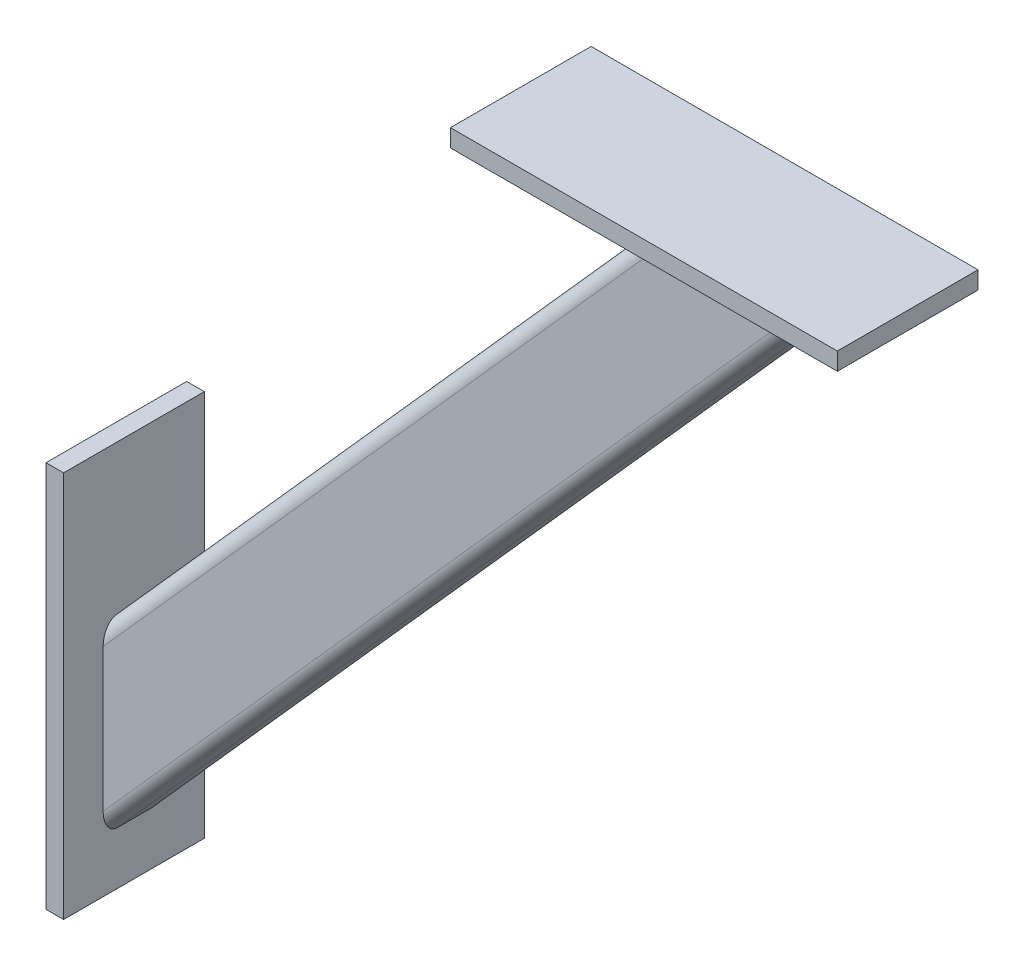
ISO-10303-21;
HEADER;
FILE_DESCRIPTION(('STEP AP214'),'2;1');
FILE_NAME('part.step','',(''),(''),'','','');
FILE_SCHEMA(('AUTOMOTIVE_DESIGN { 1 0 10303 214 1 1 1 1 }'));
ENDSEC;
DATA;
#1=APPLICATION_CONTEXT('core data for automotive mechanical design processes');
#2=APPLICATION_PROTOCOL_DEFINITION('international standard','automotive_design',2000,#1);
#3=PRODUCT_CONTEXT('',#1,'mechanical');
#4=PRODUCT('Part','Part','',(#3));
#5=PRODUCT_RELATED_PRODUCT_CATEGORY('part','',(#4));
#6=PRODUCT_DEFINITION_FORMATION('','',#4);
#7=PRODUCT_DEFINITION_CONTEXT('part definition',#1,'design');
#8=PRODUCT_DEFINITION('design','',#6,#7);
#9=PRODUCT_DEFINITION_SHAPE('','',#8);
#10=(LENGTH_UNIT() NAMED_UNIT(*) SI_UNIT(.MILLI.,.METRE.));
#11=(NAMED_UNIT(*) PLANE_ANGLE_UNIT() SI_UNIT($,.RADIAN.));
#12=(NAMED_UNIT(*) SI_UNIT($,.STERADIAN.) SOLID_ANGLE_UNIT());
#13=UNCERTAINTY_MEASURE_WITH_UNIT(LENGTH_MEASURE(1.E-05),#10,'distance_accuracy_value','');
#14=(GEOMETRIC_REPRESENTATION_CONTEXT(3) GLOBAL_UNCERTAINTY_ASSIGNED_CONTEXT((#13)) GLOBAL_UNIT_ASSIGNED_CONTEXT((#10,
#11,#12)) REPRESENTATION_CONTEXT('',''));
#15=CARTESIAN_POINT('',(0.,0.,0.));
#16=DIRECTION('',(0.,0.,1.));
#17=DIRECTION('',(1.,0.,0.));
#18=AXIS2_PLACEMENT_3D('',#15,#16,#17);
#19=CARTESIAN_POINT('',(-53.4243845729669,-447.977901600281,17.5));
#20=DIRECTION('',(0.,0.,-1.));
#21=DIRECTION('',(-1.,0.,0.));
#22=AXIS2_PLACEMENT_3D('',#19,#20,#21);
#23=PLANE('',#22);
#24=DIRECTION('',(0.,1.,0.));
#25=VECTOR('',#24,1.);
#26=CARTESIAN_POINT('',(10.,-447.977901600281,17.5));
#27=LINE('',#26,#25);
#28=CARTESIAN_POINT('',(10.0000000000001,-457.976623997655,17.5));
#29=VERTEX_POINT('',#28);
#30=CARTESIAN_POINT('',(10.,-376.81883598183,17.5));
#31=VERTEX_POINT('',#30);
#32=EDGE_CURVE('E14',#29,#31,#27,.T.);
#33=ORIENTED_EDGE('',*,*,#32,.F.);
#34=DIRECTION('',(0.665370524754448,0.746513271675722,0.));
#35=VECTOR('',#34,1.);
#36=CARTESIAN_POINT('',(-13.1126679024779,-483.907909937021,17.5));
#37=LINE('',#36,#35);
#38=CARTESIAN_POINT('',(409.283512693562,-10.,17.5));
#39=VERTEX_POINT('',#38);
#40=EDGE_CURVE('E200',#29,#39,#37,.T.);
#41=ORIENTED_EDGE('',*,*,#40,.T.);
#42=DIRECTION('',(1.,0.,0.));
#43=VECTOR('',#42,1.);
#44=CARTESIAN_POINT('',(-53.4243845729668,-9.99999999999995,17.5));
#45=LINE('',#44,#43);
#46=CARTESIAN_POINT('',(336.947223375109,-10.,17.5));
#47=VERTEX_POINT('',#46);
#48=EDGE_CURVE('E81',#47,#39,#45,.T.);
#49=ORIENTED_EDGE('',*,*,#48,.F.);
#50=DIRECTION('',(0.665370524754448,0.746513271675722,0.));
#51=VECTOR('',#50,1.);
#52=CARTESIAN_POINT('',(-53.4243845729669,-447.977901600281,17.5));
#53=LINE('',#52,#51);
#54=EDGE_CURVE('E206',#31,#47,#53,.T.);
#55=ORIENTED_EDGE('',*,*,#54,.F.);
#56=EDGE_LOOP('',(#33,#41,#49,#55));
#57=FACE_BOUND('',#56,.T.);
#58=ADVANCED_FACE('F73',(#57),#23,.F.);
#59=CARTESIAN_POINT('',(-13.1126679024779,-483.907909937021,9.49999999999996));
#60=DIRECTION('',(0.665370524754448,0.746513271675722,0.));
#61=DIRECTION('',(-0.746513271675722,0.665370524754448,0.));
#62=AXIS2_PLACEMENT_3D('',#59,#60,#61);
#63=CYLINDRICAL_SURFACE('',#62,8.00000000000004);
#64=CARTESIAN_POINT('',(10.0000000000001,-457.976623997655,9.49999999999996));
#65=DIRECTION('',(-1.,0.,0.));
#66=DIRECTION('',(0.,1.,0.));
#67=AXIS2_PLACEMENT_3D('',#64,#65,#66);
#68=ELLIPSE('',#67,12.0233760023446,8.00000000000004);
#69=CARTESIAN_POINT('',(10.0000000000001,-470.,9.49999999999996));
#70=VERTEX_POINT('',#69);
#71=EDGE_CURVE('E261',#70,#29,#68,.T.);
#72=ORIENTED_EDGE('',*,*,#71,.F.);
#73=DIRECTION('',(0.665370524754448,0.746513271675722,0.));
#74=VECTOR('',#73,1.);
#75=CARTESIAN_POINT('',(-7.14056172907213,-489.230874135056,9.49999999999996));
#76=LINE('',#75,#74);
#77=CARTESIAN_POINT('',(420.,-10.0000000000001,9.49999999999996));
#78=VERTEX_POINT('',#77);
#79=EDGE_CURVE('E202',#70,#78,#76,.T.);
#80=ORIENTED_EDGE('',*,*,#79,.T.);
#81=CARTESIAN_POINT('',(409.283512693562,-10.,9.49999999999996));
#82=DIRECTION('',(0.,1.,0.));
#83=DIRECTION('',(1.,0.,0.));
#84=AXIS2_PLACEMENT_3D('',#81,#82,#83);
#85=ELLIPSE('',#84,10.7164873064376,8.00000000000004);
#86=EDGE_CURVE('E186',#39,#78,#85,.T.);
#87=ORIENTED_EDGE('',*,*,#86,.F.);
#88=ORIENTED_EDGE('',*,*,#40,.F.);
#89=EDGE_LOOP('',(#72,#80,#87,#88));
#90=FACE_BOUND('',#89,.T.);
#91=ADVANCED_FACE('F199',(#90),#63,.T.);
#92=CARTESIAN_POINT('',(-7.14056172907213,-489.230874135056,9.49999999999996));
#93=DIRECTION('',(-0.746513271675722,0.665370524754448,0.));
#94=DIRECTION('',(-0.665370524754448,-0.746513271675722,0.));
#95=AXIS2_PLACEMENT_3D('',#92,#93,#94);
#96=PLANE('',#95);
#97=DIRECTION('',(0.,0.,1.));
#98=VECTOR('',#97,1.);
#99=CARTESIAN_POINT('',(10.0000000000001,-470.,9.49999999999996));
#100=LINE('',#99,#98);
#101=CARTESIAN_POINT('',(10.0000000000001,-470.,-9.49999999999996));
#102=VERTEX_POINT('',#101);
#103=EDGE_CURVE('E263',#102,#70,#100,.T.);
#104=ORIENTED_EDGE('',*,*,#103,.F.);
#105=DIRECTION('',(0.665370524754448,0.746513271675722,0.));
#106=VECTOR('',#105,1.);
#107=CARTESIAN_POINT('',(-7.14056172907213,-489.230874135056,-9.49999999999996));
#108=LINE('',#107,#106);
#109=CARTESIAN_POINT('',(420.,-10.0000000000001,-9.49999999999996));
#110=VERTEX_POINT('',#109);
#111=EDGE_CURVE('E208',#102,#110,#108,.T.);
#112=ORIENTED_EDGE('',*,*,#111,.T.);
#113=DIRECTION('',(0.,0.,-1.));
#114=VECTOR('',#113,1.);
#115=CARTESIAN_POINT('',(420.,-10.0000000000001,9.49999999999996));
#116=LINE('',#115,#114);
#117=EDGE_CURVE('E203',#78,#110,#116,.T.);
#118=ORIENTED_EDGE('',*,*,#117,.F.);
#119=ORIENTED_EDGE('',*,*,#79,.F.);
#120=EDGE_LOOP('',(#104,#112,#118,#119));
#121=FACE_BOUND('',#120,.T.);
#122=ADVANCED_FACE('F348',(#121),#96,.F.);
#123=CARTESIAN_POINT('',(-13.1126679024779,-483.907909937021,-9.49999999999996));
#124=DIRECTION('',(0.665370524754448,0.746513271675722,0.));
#125=DIRECTION('',(-0.746513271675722,0.665370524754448,0.));
#126=AXIS2_PLACEMENT_3D('',#123,#124,#125);
#127=CYLINDRICAL_SURFACE('',#126,8.00000000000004);
#128=CARTESIAN_POINT('',(10.0000000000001,-457.976623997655,-9.49999999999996));
#129=DIRECTION('',(-1.,0.,0.));
#130=DIRECTION('',(0.,1.,0.));
#131=AXIS2_PLACEMENT_3D('',#128,#129,#130);
#132=ELLIPSE('',#131,12.0233760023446,8.00000000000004);
#133=CARTESIAN_POINT('',(10.0000000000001,-457.976623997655,-17.5));
#134=VERTEX_POINT('',#133);
#135=EDGE_CURVE('E270',#134,#102,#132,.T.);
#136=ORIENTED_EDGE('',*,*,#135,.F.);
#137=DIRECTION('',(0.665370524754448,0.746513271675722,0.));
#138=VECTOR('',#137,1.);
#139=CARTESIAN_POINT('',(-13.1126679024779,-483.907909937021,-17.5));
#140=LINE('',#139,#138);
#141=CARTESIAN_POINT('',(409.283512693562,-10.,-17.5));
#142=VERTEX_POINT('',#141);
#143=EDGE_CURVE('E216',#134,#142,#140,.T.);
#144=ORIENTED_EDGE('',*,*,#143,.T.);
#145=CARTESIAN_POINT('',(409.283512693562,-10.,-9.49999999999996));
#146=DIRECTION('',(0.,1.,0.));
#147=DIRECTION('',(1.,0.,0.));
#148=AXIS2_PLACEMENT_3D('',#145,#146,#147);
#149=ELLIPSE('',#148,10.7164873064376,8.00000000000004);
#150=EDGE_CURVE('E527',#110,#142,#149,.T.);
#151=ORIENTED_EDGE('',*,*,#150,.F.);
#152=ORIENTED_EDGE('',*,*,#111,.F.);
#153=EDGE_LOOP('',(#136,#144,#151,#152));
#154=FACE_BOUND('',#153,.T.);
#155=ADVANCED_FACE('F353',(#154),#127,.T.);
#156=CARTESIAN_POINT('',(-53.4243845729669,-447.977901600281,-17.5));
#157=DIRECTION('',(0.,0.,1.));
#158=DIRECTION('',(1.,0.,0.));
#159=AXIS2_PLACEMENT_3D('',#156,#157,#158);
#160=PLANE('',#159);
#161=DIRECTION('',(0.,-1.,0.));
#162=VECTOR('',#161,1.);
#163=CARTESIAN_POINT('',(10.,-447.977901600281,-17.5));
#164=LINE('',#163,#162);
#165=CARTESIAN_POINT('',(10.,-376.81883598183,-17.5));
#166=VERTEX_POINT('',#165);
#167=EDGE_CURVE('E272',#166,#134,#164,.T.);
#168=ORIENTED_EDGE('',*,*,#167,.F.);
#169=DIRECTION('',(0.665370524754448,0.746513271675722,0.));
#170=VECTOR('',#169,1.);
#171=CARTESIAN_POINT('',(-53.4243845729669,-447.977901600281,-17.5));
#172=LINE('',#171,#170);
#173=CARTESIAN_POINT('',(336.947223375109,-10.,-17.5));
#174=VERTEX_POINT('',#173);
#175=EDGE_CURVE('E219',#166,#174,#172,.T.);
#176=ORIENTED_EDGE('',*,*,#175,.T.);
#177=DIRECTION('',(-1.,0.,0.));
#178=VECTOR('',#177,1.);
#179=CARTESIAN_POINT('',(-53.4243845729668,-9.99999999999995,-17.5));
#180=LINE('',#179,#178);
#181=EDGE_CURVE('E529',#142,#174,#180,.T.);
#182=ORIENTED_EDGE('',*,*,#181,.F.);
#183=ORIENTED_EDGE('',*,*,#143,.F.);
#184=EDGE_LOOP('',(#168,#176,#182,#183));
#185=FACE_BOUND('',#184,.T.);
#186=ADVANCED_FACE('F357',(#185),#160,.F.);
#187=CARTESIAN_POINT('',(-53.4243845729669,-447.977901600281,-9.49999999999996));
#188=DIRECTION('',(0.665370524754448,0.746513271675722,0.));
#189=DIRECTION('',(-0.746513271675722,0.665370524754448,0.));
#190=AXIS2_PLACEMENT_3D('',#187,#188,#189);
#191=CYLINDRICAL_SURFACE('',#190,8.00000000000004);
#192=CARTESIAN_POINT('',(10.,-376.81883598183,-9.49999999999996));
#193=DIRECTION('',(-1.,0.,0.));
#194=DIRECTION('',(0.,1.,0.));
#195=AXIS2_PLACEMENT_3D('',#192,#193,#194);
#196=ELLIPSE('',#195,12.0233760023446,8.00000000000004);
#197=CARTESIAN_POINT('',(10.,-364.795459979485,-9.49999999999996));
#198=VERTEX_POINT('',#197);
#199=EDGE_CURVE('E274',#198,#166,#196,.T.);
#200=ORIENTED_EDGE('',*,*,#199,.F.);
#201=DIRECTION('',(0.665370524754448,0.746513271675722,0.));
#202=VECTOR('',#201,1.);
#203=CARTESIAN_POINT('',(-59.3964907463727,-442.654937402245,-9.49999999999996));
#204=LINE('',#203,#202);
#205=CARTESIAN_POINT('',(326.230736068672,-10.,-9.49999999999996));
#206=VERTEX_POINT('',#205);
#207=EDGE_CURVE('E222',#198,#206,#204,.T.);
#208=ORIENTED_EDGE('',*,*,#207,.T.);
#209=CARTESIAN_POINT('',(336.947223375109,-10.,-9.49999999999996));
#210=DIRECTION('',(0.,1.,0.));
#211=DIRECTION('',(1.,0.,0.));
#212=AXIS2_PLACEMENT_3D('',#209,#210,#211);
#213=ELLIPSE('',#212,10.7164873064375,8.00000000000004);
#214=EDGE_CURVE('E533',#174,#206,#213,.T.);
#215=ORIENTED_EDGE('',*,*,#214,.F.);
#216=ORIENTED_EDGE('',*,*,#175,.F.);
#217=EDGE_LOOP('',(#200,#208,#215,#216));
#218=FACE_BOUND('',#217,.T.);
#219=ADVANCED_FACE('F361',(#218),#191,.T.);
#220=CARTESIAN_POINT('',(-59.3964907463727,-442.654937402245,9.49999999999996));
#221=DIRECTION('',(0.746513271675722,-0.665370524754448,0.));
#222=DIRECTION('',(0.665370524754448,0.746513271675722,0.));
#223=AXIS2_PLACEMENT_3D('',#220,#221,#222);
#224=PLANE('',#223);
#225=DIRECTION('',(0.,0.,-1.));
#226=VECTOR('',#225,1.);
#227=CARTESIAN_POINT('',(10.,-364.795459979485,9.49999999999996));
#228=LINE('',#227,#226);
#229=CARTESIAN_POINT('',(10.,-364.795459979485,9.49999999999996));
#230=VERTEX_POINT('',#229);
#231=EDGE_CURVE('E276',#230,#198,#228,.T.);
#232=ORIENTED_EDGE('',*,*,#231,.F.);
#233=DIRECTION('',(0.665370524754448,0.746513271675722,0.));
#234=VECTOR('',#233,1.);
#235=CARTESIAN_POINT('',(-59.3964907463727,-442.654937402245,9.49999999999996));
#236=LINE('',#235,#234);
#237=CARTESIAN_POINT('',(326.230736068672,-10.,9.49999999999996));
#238=VERTEX_POINT('',#237);
#239=EDGE_CURVE('E194',#230,#238,#236,.T.);
#240=ORIENTED_EDGE('',*,*,#239,.T.);
#241=DIRECTION('',(0.,0.,1.));
#242=VECTOR('',#241,1.);
#243=CARTESIAN_POINT('',(326.230736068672,-10.,9.49999999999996));
#244=LINE('',#243,#242);
#245=EDGE_CURVE('E326',#206,#238,#244,.T.);
#246=ORIENTED_EDGE('',*,*,#245,.F.);
#247=ORIENTED_EDGE('',*,*,#207,.F.);
#248=EDGE_LOOP('',(#232,#240,#246,#247));
#249=FACE_BOUND('',#248,.T.);
#250=ADVANCED_FACE('F340',(#249),#224,.F.);
#251=CARTESIAN_POINT('',(-53.4243845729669,-447.977901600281,9.49999999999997));
#252=DIRECTION('',(0.665370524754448,0.746513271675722,0.));
#253=DIRECTION('',(-0.746513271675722,0.665370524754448,0.));
#254=AXIS2_PLACEMENT_3D('',#251,#252,#253);
#255=CYLINDRICAL_SURFACE('',#254,8.00000000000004);
#256=CARTESIAN_POINT('',(10.,-376.81883598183,9.49999999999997));
#257=DIRECTION('',(-1.,0.,0.));
#258=DIRECTION('',(0.,1.,0.));
#259=AXIS2_PLACEMENT_3D('',#256,#257,#258);
#260=ELLIPSE('',#259,12.0233760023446,8.00000000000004);
#261=EDGE_CURVE('E278',#31,#230,#260,.T.);
#262=ORIENTED_EDGE('',*,*,#261,.F.);
#263=ORIENTED_EDGE('',*,*,#54,.T.);
#264=CARTESIAN_POINT('',(336.947223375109,-10.,9.49999999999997));
#265=DIRECTION('',(0.,1.,0.));
#266=DIRECTION('',(1.,0.,0.));
#267=AXIS2_PLACEMENT_3D('',#264,#265,#266);
#268=ELLIPSE('',#267,10.7164873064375,8.00000000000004);
#269=EDGE_CURVE('E189',#238,#47,#268,.T.);
#270=ORIENTED_EDGE('',*,*,#269,.F.);
#271=ORIENTED_EDGE('',*,*,#239,.F.);
#272=EDGE_LOOP('',(#262,#263,#270,#271));
#273=FACE_BOUND('',#272,.T.);
#274=ADVANCED_FACE('F333',(#273),#255,.T.);
#275=CARTESIAN_POINT('',(9.99999999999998,-9.99999999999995,-40.));
#276=DIRECTION('',(0.,1.,0.));
#277=DIRECTION('',(-1.,0.,0.));
#278=AXIS2_PLACEMENT_3D('',#275,#276,#277);
#279=PLANE('',#278);
#280=DIRECTION('',(0.,0.,1.));
#281=VECTOR('',#280,1.);
#282=CARTESIAN_POINT('',(331.588979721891,-10.0000000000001,9.49999999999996));
#283=LINE('',#282,#281);
#284=CARTESIAN_POINT('',(331.588979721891,-10.0000000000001,-9.49999999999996));
#285=VERTEX_POINT('',#284);
#286=CARTESIAN_POINT('',(331.588979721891,-9.99999999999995,9.49999999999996));
#287=VERTEX_POINT('',#286);
#288=EDGE_CURVE('E323',#285,#287,#283,.T.);
#289=ORIENTED_EDGE('',*,*,#288,.F.);
#290=CARTESIAN_POINT('',(336.947223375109,-10.,-9.49999999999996));
#291=DIRECTION('',(0.,1.,0.));
#292=DIRECTION('',(1.,0.,0.));
#293=AXIS2_PLACEMENT_3D('',#290,#291,#292);
#294=ELLIPSE('',#293,5.3582436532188,4.00000000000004);
#295=CARTESIAN_POINT('',(336.947223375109,-10.,-13.5));
#296=VERTEX_POINT('',#295);
#297=EDGE_CURVE('E320',#296,#285,#294,.T.);
#298=ORIENTED_EDGE('',*,*,#297,.F.);
#299=DIRECTION('',(-1.,0.,0.));
#300=VECTOR('',#299,1.);
#301=CARTESIAN_POINT('',(-53.4243845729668,-9.99999999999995,-13.5));
#302=LINE('',#301,#300);
#303=CARTESIAN_POINT('',(409.283512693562,-10.,-13.5));
#304=VERTEX_POINT('',#303);
#305=EDGE_CURVE('E315',#304,#296,#302,.T.);
#306=ORIENTED_EDGE('',*,*,#305,.F.);
#307=CARTESIAN_POINT('',(409.283512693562,-10.,-9.49999999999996));
#308=DIRECTION('',(0.,1.,0.));
#309=DIRECTION('',(1.,0.,0.));
#310=AXIS2_PLACEMENT_3D('',#307,#308,#309);
#311=ELLIPSE('',#310,5.3582436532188,4.00000000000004);
#312=CARTESIAN_POINT('',(414.641756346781,-10.0000000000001,-9.49999999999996));
#313=VERTEX_POINT('',#312);
#314=EDGE_CURVE('E310',#313,#304,#311,.T.);
#315=ORIENTED_EDGE('',*,*,#314,.F.);
#316=DIRECTION('',(0.,0.,-1.));
#317=VECTOR('',#316,1.);
#318=CARTESIAN_POINT('',(414.641756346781,-10.0000000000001,9.49999999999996));
#319=LINE('',#318,#317);
#320=CARTESIAN_POINT('',(414.641756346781,-10.0000000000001,9.49999999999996));
#321=VERTEX_POINT('',#320);
#322=EDGE_CURVE('E305',#321,#313,#319,.T.);
#323=ORIENTED_EDGE('',*,*,#322,.F.);
#324=CARTESIAN_POINT('',(409.283512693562,-10.,9.49999999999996));
#325=DIRECTION('',(0.,1.,0.));
#326=DIRECTION('',(1.,0.,0.));
#327=AXIS2_PLACEMENT_3D('',#324,#325,#326);
#328=ELLIPSE('',#327,5.3582436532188,4.00000000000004);
#329=CARTESIAN_POINT('',(409.283512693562,-10.,13.5));
#330=VERTEX_POINT('',#329);
#331=EDGE_CURVE('E265',#330,#321,#328,.T.);
#332=ORIENTED_EDGE('',*,*,#331,.F.);
#333=DIRECTION('',(1.,0.,0.));
#334=VECTOR('',#333,1.);
#335=CARTESIAN_POINT('',(-53.4243845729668,-9.99999999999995,13.5));
#336=LINE('',#335,#334);
#337=CARTESIAN_POINT('',(336.947223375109,-10.,13.5));
#338=VERTEX_POINT('',#337);
#339=EDGE_CURVE('E256',#338,#330,#336,.T.);
#340=ORIENTED_EDGE('',*,*,#339,.F.);
#341=CARTESIAN_POINT('',(336.947223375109,-10.,9.49999999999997));
#342=DIRECTION('',(0.,1.,0.));
#343=DIRECTION('',(1.,0.,0.));
#344=AXIS2_PLACEMENT_3D('',#341,#342,#343);
#345=ELLIPSE('',#344,5.3582436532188,4.00000000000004);
#346=EDGE_CURVE('E96',#287,#338,#345,.T.);
#347=ORIENTED_EDGE('',*,*,#346,.F.);
#348=EDGE_LOOP('',(#289,#298,#306,#315,#323,#332,#340,#347));
#349=FACE_BOUND('',#348,.T.);
#350=ORIENTED_EDGE('',*,*,#269,.T.);
#351=ORIENTED_EDGE('',*,*,#48,.T.);
#352=ORIENTED_EDGE('',*,*,#86,.T.);
#353=ORIENTED_EDGE('',*,*,#117,.T.);
#354=ORIENTED_EDGE('',*,*,#150,.T.);
#355=ORIENTED_EDGE('',*,*,#181,.T.);
#356=ORIENTED_EDGE('',*,*,#214,.T.);
#357=ORIENTED_EDGE('',*,*,#245,.T.);
#358=EDGE_LOOP('',(#350,#351,#352,#353,#354,#355,#356,#357));
#359=FACE_BOUND('',#358,.T.);
#360=ADVANCED_FACE('F185',(#349,#359),#279,.T.);
#361=CARTESIAN_POINT('',(9.99999999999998,-9.99999999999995,-40.));
#362=DIRECTION('',(-1.,0.,0.));
#363=DIRECTION('',(0.,-1.,0.));
#364=AXIS2_PLACEMENT_3D('',#361,#362,#363);
#365=PLANE('',#364);
#366=DIRECTION('',(0.,1.,0.));
#367=VECTOR('',#366,1.);
#368=CARTESIAN_POINT('',(10.,-447.977901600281,13.5));
#369=LINE('',#368,#367);
#370=CARTESIAN_POINT('',(10.0000000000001,-457.976623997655,13.5));
#371=VERTEX_POINT('',#370);
#372=CARTESIAN_POINT('',(10.,-376.81883598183,13.5));
#373=VERTEX_POINT('',#372);
#374=EDGE_CURVE('E257',#371,#373,#369,.T.);
#375=ORIENTED_EDGE('',*,*,#374,.F.);
#376=CARTESIAN_POINT('',(10.0000000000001,-457.976623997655,9.49999999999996));
#377=DIRECTION('',(-1.,0.,0.));
#378=DIRECTION('',(0.,1.,0.));
#379=AXIS2_PLACEMENT_3D('',#376,#377,#378);
#380=ELLIPSE('',#379,6.0116880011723,4.00000000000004);
#381=CARTESIAN_POINT('',(10.0000000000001,-463.988311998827,9.49999999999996));
#382=VERTEX_POINT('',#381);
#383=EDGE_CURVE('E292',#382,#371,#380,.T.);
#384=ORIENTED_EDGE('',*,*,#383,.F.);
#385=DIRECTION('',(0.,0.,1.));
#386=VECTOR('',#385,1.);
#387=CARTESIAN_POINT('',(10.0000000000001,-463.988311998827,9.49999999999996));
#388=LINE('',#387,#386);
#389=CARTESIAN_POINT('',(10.0000000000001,-463.988311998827,-9.49999999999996));
#390=VERTEX_POINT('',#389);
#391=EDGE_CURVE('E289',#390,#382,#388,.T.);
#392=ORIENTED_EDGE('',*,*,#391,.F.);
#393=CARTESIAN_POINT('',(10.0000000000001,-457.976623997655,-9.49999999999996));
#394=DIRECTION('',(-1.,0.,0.));
#395=DIRECTION('',(0.,1.,0.));
#396=AXIS2_PLACEMENT_3D('',#393,#394,#395);
#397=ELLIPSE('',#396,6.0116880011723,4.00000000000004);
#398=CARTESIAN_POINT('',(10.0000000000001,-457.976623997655,-13.5));
#399=VERTEX_POINT('',#398);
#400=EDGE_CURVE('E286',#399,#390,#397,.T.);
#401=ORIENTED_EDGE('',*,*,#400,.F.);
#402=DIRECTION('',(0.,-1.,0.));
#403=VECTOR('',#402,1.);
#404=CARTESIAN_POINT('',(10.,-447.977901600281,-13.5));
#405=LINE('',#404,#403);
#406=CARTESIAN_POINT('',(10.,-376.81883598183,-13.5));
#407=VERTEX_POINT('',#406);
#408=EDGE_CURVE('E283',#407,#399,#405,.T.);
#409=ORIENTED_EDGE('',*,*,#408,.F.);
#410=CARTESIAN_POINT('',(10.,-376.81883598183,-9.49999999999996));
#411=DIRECTION('',(-1.,0.,0.));
#412=DIRECTION('',(0.,1.,0.));
#413=AXIS2_PLACEMENT_3D('',#410,#411,#412);
#414=ELLIPSE('',#413,6.0116880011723,4.00000000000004);
#415=CARTESIAN_POINT('',(10.0000000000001,-370.807147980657,-9.49999999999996));
#416=VERTEX_POINT('',#415);
#417=EDGE_CURVE('E88',#416,#407,#414,.T.);
#418=ORIENTED_EDGE('',*,*,#417,.F.);
#419=DIRECTION('',(0.,0.,-1.));
#420=VECTOR('',#419,1.);
#421=CARTESIAN_POINT('',(10.,-370.807147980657,9.49999999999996));
#422=LINE('',#421,#420);
#423=CARTESIAN_POINT('',(10.,-370.807147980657,9.49999999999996));
#424=VERTEX_POINT('',#423);
#425=EDGE_CURVE('E280',#424,#416,#422,.T.);
#426=ORIENTED_EDGE('',*,*,#425,.F.);
#427=CARTESIAN_POINT('',(10.,-376.81883598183,9.49999999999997));
#428=DIRECTION('',(-1.,0.,0.));
#429=DIRECTION('',(0.,1.,0.));
#430=AXIS2_PLACEMENT_3D('',#427,#428,#429);
#431=ELLIPSE('',#430,6.0116880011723,4.00000000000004);
#432=EDGE_CURVE('E231',#373,#424,#431,.T.);
#433=ORIENTED_EDGE('',*,*,#432,.F.);
#434=EDGE_LOOP('',(#375,#384,#392,#401,#409,#418,#426,#433));
#435=FACE_BOUND('',#434,.T.);
#436=ORIENTED_EDGE('',*,*,#261,.T.);
#437=ORIENTED_EDGE('',*,*,#231,.T.);
#438=ORIENTED_EDGE('',*,*,#199,.T.);
#439=ORIENTED_EDGE('',*,*,#167,.T.);
#440=ORIENTED_EDGE('',*,*,#135,.T.);
#441=ORIENTED_EDGE('',*,*,#103,.T.);
#442=ORIENTED_EDGE('',*,*,#71,.T.);
#443=ORIENTED_EDGE('',*,*,#32,.T.);
#444=EDGE_LOOP('',(#436,#437,#438,#439,#440,#441,#442,#443));
#445=FACE_BOUND('',#444,.T.);
#446=ADVANCED_FACE('F299',(#435,#445),#365,.T.);
#447=CARTESIAN_POINT('',(-53.4243845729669,-447.977901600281,9.49999999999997));
#448=DIRECTION('',(0.665370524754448,0.746513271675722,0.));
#449=DIRECTION('',(-0.746513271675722,0.665370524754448,0.));
#450=AXIS2_PLACEMENT_3D('',#447,#448,#449);
#451=CYLINDRICAL_SURFACE('',#450,4.00000000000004);
#452=DIRECTION('',(0.665370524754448,0.746513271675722,0.));
#453=VECTOR('',#452,1.);
#454=CARTESIAN_POINT('',(-53.4243845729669,-447.977901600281,13.5));
#455=LINE('',#454,#453);
#456=EDGE_CURVE('E210',#373,#338,#455,.T.);
#457=ORIENTED_EDGE('',*,*,#456,.F.);
#458=ORIENTED_EDGE('',*,*,#432,.T.);
#459=DIRECTION('',(0.665370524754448,0.746513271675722,0.));
#460=VECTOR('',#459,1.);
#461=CARTESIAN_POINT('',(-56.4104376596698,-445.316419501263,9.49999999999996));
#462=LINE('',#461,#460);
#463=EDGE_CURVE('E227',#424,#287,#462,.T.);
#464=ORIENTED_EDGE('',*,*,#463,.T.);
#465=ORIENTED_EDGE('',*,*,#346,.T.);
#466=EDGE_LOOP('',(#457,#458,#464,#465));
#467=FACE_BOUND('',#466,.T.);
#468=ADVANCED_FACE('F75',(#467),#451,.F.);
#469=CARTESIAN_POINT('',(-53.4243845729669,-447.977901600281,13.5));
#470=DIRECTION('',(0.,0.,-1.));
#471=DIRECTION('',(-1.,0.,0.));
#472=AXIS2_PLACEMENT_3D('',#469,#470,#471);
#473=PLANE('',#472);
#474=DIRECTION('',(0.665370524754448,0.746513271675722,0.));
#475=VECTOR('',#474,1.);
#476=CARTESIAN_POINT('',(-13.1126679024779,-483.907909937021,13.5));
#477=LINE('',#476,#475);
#478=EDGE_CURVE('E246',#371,#330,#477,.T.);
#479=ORIENTED_EDGE('',*,*,#478,.F.);
#480=ORIENTED_EDGE('',*,*,#374,.T.);
#481=ORIENTED_EDGE('',*,*,#456,.T.);
#482=ORIENTED_EDGE('',*,*,#339,.T.);
#483=EDGE_LOOP('',(#479,#480,#481,#482));
#484=FACE_BOUND('',#483,.T.);
#485=ADVANCED_FACE('F255',(#484),#473,.T.);
#486=CARTESIAN_POINT('',(-13.1126679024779,-483.907909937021,9.49999999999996));
#487=DIRECTION('',(0.665370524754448,0.746513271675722,0.));
#488=DIRECTION('',(-0.746513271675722,0.665370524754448,0.));
#489=AXIS2_PLACEMENT_3D('',#486,#487,#488);
#490=CYLINDRICAL_SURFACE('',#489,4.00000000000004);
#491=DIRECTION('',(0.665370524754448,0.746513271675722,0.));
#492=VECTOR('',#491,1.);
#493=CARTESIAN_POINT('',(-10.126614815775,-486.569392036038,9.49999999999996));
#494=LINE('',#493,#492);
#495=EDGE_CURVE('E243',#382,#321,#494,.T.);
#496=ORIENTED_EDGE('',*,*,#495,.F.);
#497=ORIENTED_EDGE('',*,*,#383,.T.);
#498=ORIENTED_EDGE('',*,*,#478,.T.);
#499=ORIENTED_EDGE('',*,*,#331,.T.);
#500=EDGE_LOOP('',(#496,#497,#498,#499));
#501=FACE_BOUND('',#500,.T.);
#502=ADVANCED_FACE('F297',(#501),#490,.F.);
#503=CARTESIAN_POINT('',(-10.126614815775,-486.569392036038,9.49999999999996));
#504=DIRECTION('',(-0.746513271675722,0.665370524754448,0.));
#505=DIRECTION('',(-0.665370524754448,-0.746513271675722,0.));
#506=AXIS2_PLACEMENT_3D('',#503,#504,#505);
#507=PLANE('',#506);
#508=DIRECTION('',(0.665370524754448,0.746513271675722,0.));
#509=VECTOR('',#508,1.);
#510=CARTESIAN_POINT('',(-10.126614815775,-486.569392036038,-9.49999999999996));
#511=LINE('',#510,#509);
#512=EDGE_CURVE('E240',#390,#313,#511,.T.);
#513=ORIENTED_EDGE('',*,*,#512,.F.);
#514=ORIENTED_EDGE('',*,*,#391,.T.);
#515=ORIENTED_EDGE('',*,*,#495,.T.);
#516=ORIENTED_EDGE('',*,*,#322,.T.);
#517=EDGE_LOOP('',(#513,#514,#515,#516));
#518=FACE_BOUND('',#517,.T.);
#519=ADVANCED_FACE('F303',(#518),#507,.T.);
#520=CARTESIAN_POINT('',(-13.1126679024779,-483.907909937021,-9.49999999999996));
#521=DIRECTION('',(0.665370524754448,0.746513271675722,0.));
#522=DIRECTION('',(-0.746513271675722,0.665370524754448,0.));
#523=AXIS2_PLACEMENT_3D('',#520,#521,#522);
#524=CYLINDRICAL_SURFACE('',#523,4.00000000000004);
#525=DIRECTION('',(0.665370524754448,0.746513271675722,0.));
#526=VECTOR('',#525,1.);
#527=CARTESIAN_POINT('',(-13.1126679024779,-483.907909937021,-13.5));
#528=LINE('',#527,#526);
#529=EDGE_CURVE('E237',#399,#304,#528,.T.);
#530=ORIENTED_EDGE('',*,*,#529,.F.);
#531=ORIENTED_EDGE('',*,*,#400,.T.);
#532=ORIENTED_EDGE('',*,*,#512,.T.);
#533=ORIENTED_EDGE('',*,*,#314,.T.);
#534=EDGE_LOOP('',(#530,#531,#532,#533));
#535=FACE_BOUND('',#534,.T.);
#536=ADVANCED_FACE('F309',(#535),#524,.F.);
#537=CARTESIAN_POINT('',(-53.4243845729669,-447.977901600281,-13.5));
#538=DIRECTION('',(0.,0.,1.));
#539=DIRECTION('',(1.,0.,0.));
#540=AXIS2_PLACEMENT_3D('',#537,#538,#539);
#541=PLANE('',#540);
#542=DIRECTION('',(0.665370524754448,0.746513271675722,0.));
#543=VECTOR('',#542,1.);
#544=CARTESIAN_POINT('',(-53.4243845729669,-447.977901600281,-13.5));
#545=LINE('',#544,#543);
#546=EDGE_CURVE('E234',#407,#296,#545,.T.);
#547=ORIENTED_EDGE('',*,*,#546,.F.);
#548=ORIENTED_EDGE('',*,*,#408,.T.);
#549=ORIENTED_EDGE('',*,*,#529,.T.);
#550=ORIENTED_EDGE('',*,*,#305,.T.);
#551=EDGE_LOOP('',(#547,#548,#549,#550));
#552=FACE_BOUND('',#551,.T.);
#553=ADVANCED_FACE('F313',(#552),#541,.T.);
#554=CARTESIAN_POINT('',(-53.4243845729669,-447.977901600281,-9.49999999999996));
#555=DIRECTION('',(0.665370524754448,0.746513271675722,0.));
#556=DIRECTION('',(-0.746513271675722,0.665370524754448,0.));
#557=AXIS2_PLACEMENT_3D('',#554,#555,#556);
#558=CYLINDRICAL_SURFACE('',#557,4.00000000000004);
#559=DIRECTION('',(0.665370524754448,0.746513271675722,0.));
#560=VECTOR('',#559,1.);
#561=CARTESIAN_POINT('',(-56.4104376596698,-445.316419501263,-9.49999999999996));
#562=LINE('',#561,#560);
#563=EDGE_CURVE('E230',#416,#285,#562,.T.);
#564=ORIENTED_EDGE('',*,*,#563,.F.);
#565=ORIENTED_EDGE('',*,*,#417,.T.);
#566=ORIENTED_EDGE('',*,*,#546,.T.);
#567=ORIENTED_EDGE('',*,*,#297,.T.);
#568=EDGE_LOOP('',(#564,#565,#566,#567));
#569=FACE_BOUND('',#568,.T.);
#570=ADVANCED_FACE('F319',(#569),#558,.F.);
#571=CARTESIAN_POINT('',(-56.4104376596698,-445.316419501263,9.49999999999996));
#572=DIRECTION('',(0.746513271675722,-0.665370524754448,0.));
#573=DIRECTION('',(0.665370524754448,0.746513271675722,0.));
#574=AXIS2_PLACEMENT_3D('',#571,#572,#573);
#575=PLANE('',#574);
#576=ORIENTED_EDGE('',*,*,#463,.F.);
#577=ORIENTED_EDGE('',*,*,#425,.T.);
#578=ORIENTED_EDGE('',*,*,#563,.T.);
#579=ORIENTED_EDGE('',*,*,#288,.T.);
#580=EDGE_LOOP('',(#576,#577,#578,#579));
#581=FACE_BOUND('',#580,.T.);
#582=ADVANCED_FACE('F322',(#581),#575,.T.);
#583=CLOSED_SHELL('',(#58,#91,#122,#155,#186,#219,#250,#274,#360,#446,#468,#485,#502,#519,#536,
#553,#570,#582));
#584=MANIFOLD_SOLID_BREP('B2',#583);
#585=CARTESIAN_POINT('',(450.,0.,40.));
#586=DIRECTION('',(0.,-1.,0.));
#587=DIRECTION('',(1.,0.,0.));
#588=AXIS2_PLACEMENT_3D('',#585,#586,#587);
#589=PLANE('',#588);
#590=DIRECTION('',(-1.,0.,0.));
#591=VECTOR('',#590,1.);
#592=CARTESIAN_POINT('',(450.,0.,-40.));
#593=LINE('',#592,#591);
#594=CARTESIAN_POINT('',(450.,0.,-40.));
#595=VERTEX_POINT('',#594);
#596=CARTESIAN_POINT('',(230.,0.,-40.));
#597=VERTEX_POINT('',#596);
#598=EDGE_CURVE('E615',#595,#597,#593,.T.);
#599=ORIENTED_EDGE('',*,*,#598,.T.);
#600=DIRECTION('',(0.,0.,-1.));
#601=VECTOR('',#600,1.);
#602=CARTESIAN_POINT('',(230.,0.,40.));
#603=LINE('',#602,#601);
#604=CARTESIAN_POINT('',(230.,0.,40.));
#605=VERTEX_POINT('',#604);
#606=EDGE_CURVE('E71',#605,#597,#603,.T.);
#607=ORIENTED_EDGE('',*,*,#606,.F.);
#608=DIRECTION('',(-1.,0.,0.));
#609=VECTOR('',#608,1.);
#610=CARTESIAN_POINT('',(450.,0.,40.));
#611=LINE('',#610,#609);
#612=CARTESIAN_POINT('',(450.,0.,40.));
#613=VERTEX_POINT('',#612);
#614=EDGE_CURVE('E592',#613,#605,#611,.T.);
#615=ORIENTED_EDGE('',*,*,#614,.F.);
#616=DIRECTION('',(0.,0.,-1.));
#617=VECTOR('',#616,1.);
#618=CARTESIAN_POINT('',(450.,0.,40.));
#619=LINE('',#618,#617);
#620=EDGE_CURVE('E568',#613,#595,#619,.T.);
#621=ORIENTED_EDGE('',*,*,#620,.T.);
#622=EDGE_LOOP('',(#599,#607,#615,#621));
#623=FACE_BOUND('',#622,.T.);
#624=ADVANCED_FACE('F552',(#623),#589,.F.);
#625=CARTESIAN_POINT('',(230.,-10.,40.));
#626=DIRECTION('',(-1.,0.,0.));
#627=DIRECTION('',(0.,0.,1.));
#628=AXIS2_PLACEMENT_3D('',#625,#626,#627);
#629=PLANE('',#628);
#630=DIRECTION('',(0.,1.,0.));
#631=VECTOR('',#630,1.);
#632=CARTESIAN_POINT('',(230.,-10.,-40.));
#633=LINE('',#632,#631);
#634=CARTESIAN_POINT('',(230.,-10.,-40.));
#635=VERTEX_POINT('',#634);
#636=EDGE_CURVE('E601',#635,#597,#633,.T.);
#637=ORIENTED_EDGE('',*,*,#636,.F.);
#638=DIRECTION('',(0.,0.,-1.));
#639=VECTOR('',#638,1.);
#640=CARTESIAN_POINT('',(230.,-10.,40.));
#641=LINE('',#640,#639);
#642=CARTESIAN_POINT('',(230.,-10.,40.));
#643=VERTEX_POINT('',#642);
#644=EDGE_CURVE('E560',#643,#635,#641,.T.);
#645=ORIENTED_EDGE('',*,*,#644,.F.);
#646=DIRECTION('',(0.,1.,0.));
#647=VECTOR('',#646,1.);
#648=CARTESIAN_POINT('',(230.,-10.,40.));
#649=LINE('',#648,#647);
#650=EDGE_CURVE('E599',#643,#605,#649,.T.);
#651=ORIENTED_EDGE('',*,*,#650,.T.);
#652=ORIENTED_EDGE('',*,*,#606,.T.);
#653=EDGE_LOOP('',(#637,#645,#651,#652));
#654=FACE_BOUND('',#653,.T.);
#655=ADVANCED_FACE('F598',(#654),#629,.T.);
#656=CARTESIAN_POINT('',(450.,-10.,40.));
#657=DIRECTION('',(0.,-1.,0.));
#658=DIRECTION('',(1.,0.,0.));
#659=AXIS2_PLACEMENT_3D('',#656,#657,#658);
#660=PLANE('',#659);
#661=DIRECTION('',(-1.,0.,0.));
#662=VECTOR('',#661,1.);
#663=CARTESIAN_POINT('',(450.,-10.,-40.));
#664=LINE('',#663,#662);
#665=CARTESIAN_POINT('',(450.,-10.,-40.));
#666=VERTEX_POINT('',#665);
#667=EDGE_CURVE('E618',#666,#635,#664,.T.);
#668=ORIENTED_EDGE('',*,*,#667,.F.);
#669=DIRECTION('',(0.,0.,-1.));
#670=VECTOR('',#669,1.);
#671=CARTESIAN_POINT('',(450.,-10.,40.));
#672=LINE('',#671,#670);
#673=CARTESIAN_POINT('',(450.,-10.,40.));
#674=VERTEX_POINT('',#673);
#675=EDGE_CURVE('E581',#674,#666,#672,.T.);
#676=ORIENTED_EDGE('',*,*,#675,.F.);
#677=DIRECTION('',(-1.,0.,0.));
#678=VECTOR('',#677,1.);
#679=CARTESIAN_POINT('',(450.,-10.,40.));
#680=LINE('',#679,#678);
#681=EDGE_CURVE('E607',#674,#643,#680,.T.);
#682=ORIENTED_EDGE('',*,*,#681,.T.);
#683=ORIENTED_EDGE('',*,*,#644,.T.);
#684=EDGE_LOOP('',(#668,#676,#682,#683));
#685=FACE_BOUND('',#684,.T.);
#686=ADVANCED_FACE('F609',(#685),#660,.T.);
#687=CARTESIAN_POINT('',(450.,0.,40.));
#688=DIRECTION('',(1.,0.,0.));
#689=DIRECTION('',(0.,0.,-1.));
#690=AXIS2_PLACEMENT_3D('',#687,#688,#689);
#691=PLANE('',#690);
#692=DIRECTION('',(0.,-1.,0.));
#693=VECTOR('',#692,1.);
#694=CARTESIAN_POINT('',(450.,0.,-40.));
#695=LINE('',#694,#693);
#696=EDGE_CURVE('E620',#595,#666,#695,.T.);
#697=ORIENTED_EDGE('',*,*,#696,.F.);
#698=ORIENTED_EDGE('',*,*,#620,.F.);
#699=DIRECTION('',(0.,-1.,0.));
#700=VECTOR('',#699,1.);
#701=CARTESIAN_POINT('',(450.,0.,40.));
#702=LINE('',#701,#700);
#703=EDGE_CURVE('E610',#613,#674,#702,.T.);
#704=ORIENTED_EDGE('',*,*,#703,.T.);
#705=ORIENTED_EDGE('',*,*,#675,.T.);
#706=EDGE_LOOP('',(#697,#698,#704,#705));
#707=FACE_BOUND('',#706,.T.);
#708=ADVANCED_FACE('F626',(#707),#691,.T.);
#709=CARTESIAN_POINT('',(0.,0.,40.));
#710=DIRECTION('',(0.,0.,-1.));
#711=DIRECTION('',(-1.,0.,0.));
#712=AXIS2_PLACEMENT_3D('',#709,#710,#711);
#713=PLANE('',#712);
#714=ORIENTED_EDGE('',*,*,#614,.T.);
#715=ORIENTED_EDGE('',*,*,#650,.F.);
#716=ORIENTED_EDGE('',*,*,#681,.F.);
#717=ORIENTED_EDGE('',*,*,#703,.F.);
#718=EDGE_LOOP('',(#714,#715,#716,#717));
#719=FACE_BOUND('',#718,.T.);
#720=ADVANCED_FACE('F606',(#719),#713,.F.);
#721=CARTESIAN_POINT('',(0.,0.,-40.));
#722=DIRECTION('',(0.,0.,-1.));
#723=DIRECTION('',(-1.,0.,0.));
#724=AXIS2_PLACEMENT_3D('',#721,#722,#723);
#725=PLANE('',#724);
#726=ORIENTED_EDGE('',*,*,#598,.F.);
#727=ORIENTED_EDGE('',*,*,#696,.T.);
#728=ORIENTED_EDGE('',*,*,#667,.T.);
#729=ORIENTED_EDGE('',*,*,#636,.T.);
#730=EDGE_LOOP('',(#726,#727,#728,#729));
#731=FACE_BOUND('',#730,.T.);
#732=ADVANCED_FACE('F625',(#731),#725,.T.);
#733=CLOSED_SHELL('',(#624,#655,#686,#708,#720,#732));
#734=MANIFOLD_SOLID_BREP('B8',#733);
#735=CARTESIAN_POINT('',(0.,-280.,40.));
#736=DIRECTION('',(1.,0.,0.));
#737=DIRECTION('',(0.,1.,0.));
#738=AXIS2_PLACEMENT_3D('',#735,#736,#737);
#739=PLANE('',#738);
#740=DIRECTION('',(0.,-1.,0.));
#741=VECTOR('',#740,1.);
#742=CARTESIAN_POINT('',(0.,-280.,-40.));
#743=LINE('',#742,#741);
#744=CARTESIAN_POINT('',(0.,-280.,-40.));
#745=VERTEX_POINT('',#744);
#746=CARTESIAN_POINT('',(0.,-500.,-40.));
#747=VERTEX_POINT('',#746);
#748=EDGE_CURVE('E739',#745,#747,#743,.T.);
#749=ORIENTED_EDGE('',*,*,#748,.T.);
#750=DIRECTION('',(0.,0.,-1.));
#751=VECTOR('',#750,1.);
#752=CARTESIAN_POINT('',(0.,-500.,40.));
#753=LINE('',#752,#751);
#754=CARTESIAN_POINT('',(0.,-500.,40.));
#755=VERTEX_POINT('',#754);
#756=EDGE_CURVE('E550',#755,#747,#753,.T.);
#757=ORIENTED_EDGE('',*,*,#756,.F.);
#758=DIRECTION('',(0.,-1.,0.));
#759=VECTOR('',#758,1.);
#760=CARTESIAN_POINT('',(0.,-280.,40.));
#761=LINE('',#760,#759);
#762=CARTESIAN_POINT('',(0.,-280.,40.));
#763=VERTEX_POINT('',#762);
#764=EDGE_CURVE('E716',#763,#755,#761,.T.);
#765=ORIENTED_EDGE('',*,*,#764,.F.);
#766=DIRECTION('',(0.,0.,-1.));
#767=VECTOR('',#766,1.);
#768=CARTESIAN_POINT('',(0.,-280.,40.));
#769=LINE('',#768,#767);
#770=EDGE_CURVE('E692',#763,#745,#769,.T.);
#771=ORIENTED_EDGE('',*,*,#770,.T.);
#772=EDGE_LOOP('',(#749,#757,#765,#771));
#773=FACE_BOUND('',#772,.T.);
#774=ADVANCED_FACE('F676',(#773),#739,.F.);
#775=CARTESIAN_POINT('',(10.,-500.,40.));
#776=DIRECTION('',(0.,-1.,0.));
#777=DIRECTION('',(0.,0.,-1.));
#778=AXIS2_PLACEMENT_3D('',#775,#776,#777);
#779=PLANE('',#778);
#780=DIRECTION('',(-1.,0.,0.));
#781=VECTOR('',#780,1.);
#782=CARTESIAN_POINT('',(10.,-500.,-40.));
#783=LINE('',#782,#781);
#784=CARTESIAN_POINT('',(10.,-500.,-40.));
#785=VERTEX_POINT('',#784);
#786=EDGE_CURVE('E725',#785,#747,#783,.T.);
#787=ORIENTED_EDGE('',*,*,#786,.F.);
#788=DIRECTION('',(0.,0.,-1.));
#789=VECTOR('',#788,1.);
#790=CARTESIAN_POINT('',(10.,-500.,40.));
#791=LINE('',#790,#789);
#792=CARTESIAN_POINT('',(10.,-500.,40.));
#793=VERTEX_POINT('',#792);
#794=EDGE_CURVE('E684',#793,#785,#791,.T.);
#795=ORIENTED_EDGE('',*,*,#794,.F.);
#796=DIRECTION('',(-1.,0.,0.));
#797=VECTOR('',#796,1.);
#798=CARTESIAN_POINT('',(10.,-500.,40.));
#799=LINE('',#798,#797);
#800=EDGE_CURVE('E723',#793,#755,#799,.T.);
#801=ORIENTED_EDGE('',*,*,#800,.T.);
#802=ORIENTED_EDGE('',*,*,#756,.T.);
#803=EDGE_LOOP('',(#787,#795,#801,#802));
#804=FACE_BOUND('',#803,.T.);
#805=ADVANCED_FACE('F722',(#804),#779,.T.);
#806=CARTESIAN_POINT('',(9.99999999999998,-280.,40.));
#807=DIRECTION('',(1.,0.,0.));
#808=DIRECTION('',(0.,1.,0.));
#809=AXIS2_PLACEMENT_3D('',#806,#807,#808);
#810=PLANE('',#809);
#811=DIRECTION('',(0.,-1.,0.));
#812=VECTOR('',#811,1.);
#813=CARTESIAN_POINT('',(9.99999999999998,-280.,-40.));
#814=LINE('',#813,#812);
#815=CARTESIAN_POINT('',(9.99999999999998,-280.,-40.));
#816=VERTEX_POINT('',#815);
#817=EDGE_CURVE('E742',#816,#785,#814,.T.);
#818=ORIENTED_EDGE('',*,*,#817,.F.);
#819=DIRECTION('',(0.,0.,-1.));
#820=VECTOR('',#819,1.);
#821=CARTESIAN_POINT('',(9.99999999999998,-280.,40.));
#822=LINE('',#821,#820);
#823=CARTESIAN_POINT('',(9.99999999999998,-280.,40.));
#824=VERTEX_POINT('',#823);
#825=EDGE_CURVE('E705',#824,#816,#822,.T.);
#826=ORIENTED_EDGE('',*,*,#825,.F.);
#827=DIRECTION('',(0.,-1.,0.));
#828=VECTOR('',#827,1.);
#829=CARTESIAN_POINT('',(9.99999999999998,-280.,40.));
#830=LINE('',#829,#828);
#831=EDGE_CURVE('E731',#824,#793,#830,.T.);
#832=ORIENTED_EDGE('',*,*,#831,.T.);
#833=ORIENTED_EDGE('',*,*,#794,.T.);
#834=EDGE_LOOP('',(#818,#826,#832,#833));
#835=FACE_BOUND('',#834,.T.);
#836=ADVANCED_FACE('F733',(#835),#810,.T.);
#837=CARTESIAN_POINT('',(0.,-280.,40.));
#838=DIRECTION('',(0.,1.,0.));
#839=DIRECTION('',(0.,0.,1.));
#840=AXIS2_PLACEMENT_3D('',#837,#838,#839);
#841=PLANE('',#840);
#842=DIRECTION('',(1.,0.,0.));
#843=VECTOR('',#842,1.);
#844=CARTESIAN_POINT('',(0.,-280.,-40.));
#845=LINE('',#844,#843);
#846=EDGE_CURVE('E744',#745,#816,#845,.T.);
#847=ORIENTED_EDGE('',*,*,#846,.F.);
#848=ORIENTED_EDGE('',*,*,#770,.F.);
#849=DIRECTION('',(1.,0.,0.));
#850=VECTOR('',#849,1.);
#851=CARTESIAN_POINT('',(0.,-280.,40.));
#852=LINE('',#851,#850);
#853=EDGE_CURVE('E734',#763,#824,#852,.T.);
#854=ORIENTED_EDGE('',*,*,#853,.T.);
#855=ORIENTED_EDGE('',*,*,#825,.T.);
#856=EDGE_LOOP('',(#847,#848,#854,#855));
#857=FACE_BOUND('',#856,.T.);
#858=ADVANCED_FACE('F750',(#857),#841,.T.);
#859=CARTESIAN_POINT('',(0.,0.,40.));
#860=DIRECTION('',(0.,0.,-1.));
#861=DIRECTION('',(-1.,0.,0.));
#862=AXIS2_PLACEMENT_3D('',#859,#860,#861);
#863=PLANE('',#862);
#864=ORIENTED_EDGE('',*,*,#764,.T.);
#865=ORIENTED_EDGE('',*,*,#800,.F.);
#866=ORIENTED_EDGE('',*,*,#831,.F.);
#867=ORIENTED_EDGE('',*,*,#853,.F.);
#868=EDGE_LOOP('',(#864,#865,#866,#867));
#869=FACE_BOUND('',#868,.T.);
#870=ADVANCED_FACE('F730',(#869),#863,.F.);
#871=CARTESIAN_POINT('',(0.,0.,-40.));
#872=DIRECTION('',(0.,0.,-1.));
#873=DIRECTION('',(-1.,0.,0.));
#874=AXIS2_PLACEMENT_3D('',#871,#872,#873);
#875=PLANE('',#874);
#876=ORIENTED_EDGE('',*,*,#748,.F.);
#877=ORIENTED_EDGE('',*,*,#846,.T.);
#878=ORIENTED_EDGE('',*,*,#817,.T.);
#879=ORIENTED_EDGE('',*,*,#786,.T.);
#880=EDGE_LOOP('',(#876,#877,#878,#879));
#881=FACE_BOUND('',#880,.T.);
#882=ADVANCED_FACE('F749',(#881),#875,.T.);
#883=CLOSED_SHELL('',(#774,#805,#836,#858,#870,#882));
#884=MANIFOLD_SOLID_BREP('B65',#883);
#885=ADVANCED_BREP_SHAPE_REPRESENTATION('',(#18,#584,#734,#884),#14);
#886=SHAPE_DEFINITION_REPRESENTATION(#9,#885);
ENDSEC;
END-ISO-10303-21;
